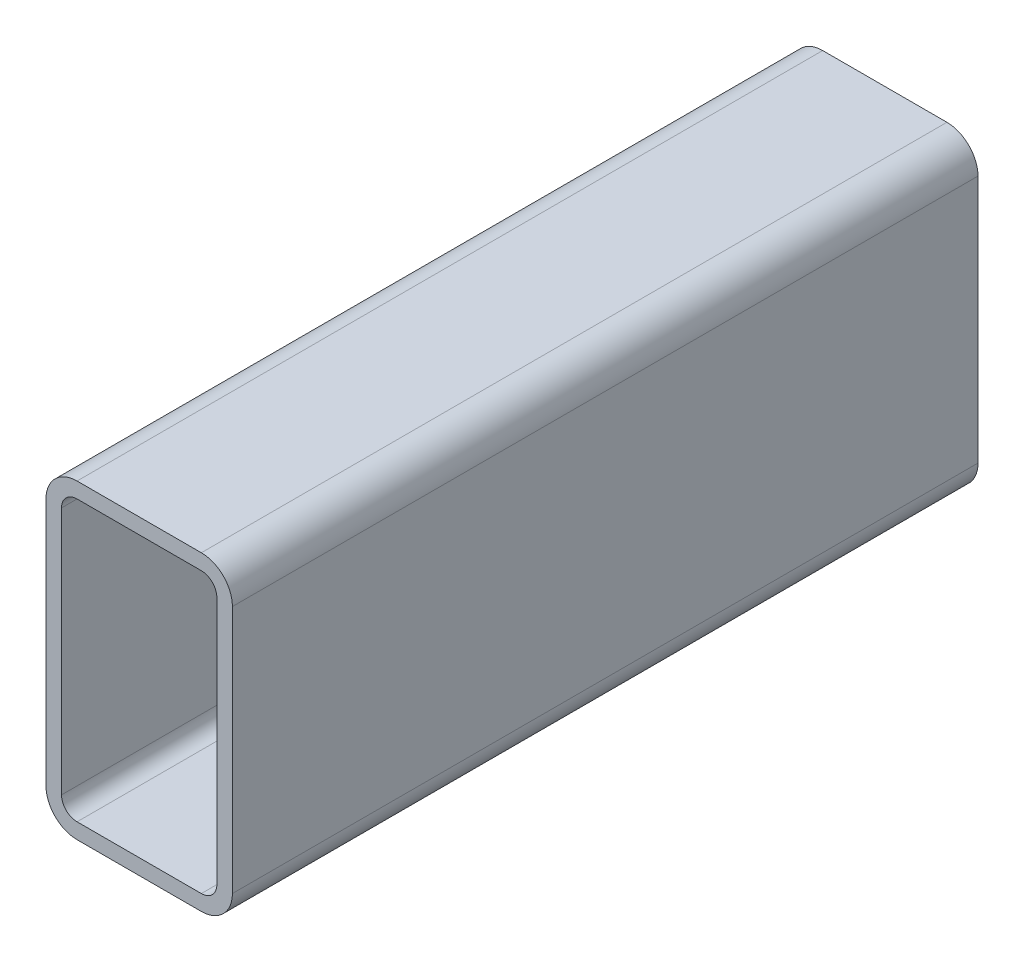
ISO-10303-21;
HEADER;
FILE_DESCRIPTION(('STEP AP214'),'2;1');
FILE_NAME('part.step','',(''),(''),'','','');
FILE_SCHEMA(('AUTOMOTIVE_DESIGN { 1 0 10303 214 1 1 1 1 }'));
ENDSEC;
DATA;
#1=APPLICATION_CONTEXT('core data for automotive mechanical design processes');
#2=APPLICATION_PROTOCOL_DEFINITION('international standard','automotive_design',2000,#1);
#3=PRODUCT_CONTEXT('',#1,'mechanical');
#4=PRODUCT('Part','Part','',(#3));
#5=PRODUCT_RELATED_PRODUCT_CATEGORY('part','',(#4));
#6=PRODUCT_DEFINITION_FORMATION('','',#4);
#7=PRODUCT_DEFINITION_CONTEXT('part definition',#1,'design');
#8=PRODUCT_DEFINITION('design','',#6,#7);
#9=PRODUCT_DEFINITION_SHAPE('','',#8);
#10=(LENGTH_UNIT() NAMED_UNIT(*) SI_UNIT(.MILLI.,.METRE.));
#11=(NAMED_UNIT(*) PLANE_ANGLE_UNIT() SI_UNIT($,.RADIAN.));
#12=(NAMED_UNIT(*) SI_UNIT($,.STERADIAN.) SOLID_ANGLE_UNIT());
#13=UNCERTAINTY_MEASURE_WITH_UNIT(LENGTH_MEASURE(1.E-05),#10,'distance_accuracy_value','');
#14=(GEOMETRIC_REPRESENTATION_CONTEXT(3) GLOBAL_UNCERTAINTY_ASSIGNED_CONTEXT((#13)) GLOBAL_UNIT_ASSIGNED_CONTEXT((#10,
#11,#12)) REPRESENTATION_CONTEXT('',''));
#15=CARTESIAN_POINT('',(0.,0.,0.));
#16=DIRECTION('',(0.,0.,1.));
#17=DIRECTION('',(1.,0.,0.));
#18=AXIS2_PLACEMENT_3D('',#15,#16,#17);
#19=CARTESIAN_POINT('',(15.1891160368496,116.33485662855,304.8));
#20=DIRECTION('',(0.,0.,1.));
#21=DIRECTION('',(1.,0.,0.));
#22=AXIS2_PLACEMENT_3D('',#19,#20,#21);
#23=PLANE('',#22);
#24=CARTESIAN_POINT('',(15.1891160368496,116.33485662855,304.8));
#25=DIRECTION('',(0.,0.,1.));
#26=DIRECTION('',(1.,0.,0.));
#27=AXIS2_PLACEMENT_3D('',#24,#25,#26);
#28=CIRCLE('',#27,12.7);
#29=CARTESIAN_POINT('',(15.1891160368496,129.03485662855,304.8));
#30=VERTEX_POINT('',#29);
#31=CARTESIAN_POINT('',(2.48911603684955,116.33485662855,304.8));
#32=VERTEX_POINT('',#31);
#33=EDGE_CURVE('E211',#30,#32,#28,.T.);
#34=ORIENTED_EDGE('',*,*,#33,.T.);
#35=DIRECTION('',(0.,-1.,0.));
#36=VECTOR('',#35,1.);
#37=CARTESIAN_POINT('',(2.48911603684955,14.73485662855,304.8));
#38=LINE('',#37,#36);
#39=CARTESIAN_POINT('',(2.48911603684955,14.73485662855,304.8));
#40=VERTEX_POINT('',#39);
#41=EDGE_CURVE('E214',#32,#40,#38,.T.);
#42=ORIENTED_EDGE('',*,*,#41,.T.);
#43=CARTESIAN_POINT('',(15.1891160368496,14.73485662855,304.8));
#44=DIRECTION('',(0.,0.,1.));
#45=DIRECTION('',(1.,0.,0.));
#46=AXIS2_PLACEMENT_3D('',#43,#44,#45);
#47=CIRCLE('',#46,12.7);
#48=CARTESIAN_POINT('',(15.1891160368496,2.03485662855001,304.8));
#49=VERTEX_POINT('',#48);
#50=EDGE_CURVE('E217',#40,#49,#47,.T.);
#51=ORIENTED_EDGE('',*,*,#50,.T.);
#52=DIRECTION('',(1.,0.,0.));
#53=VECTOR('',#52,1.);
#54=CARTESIAN_POINT('',(65.9891160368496,2.03485662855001,304.8));
#55=LINE('',#54,#53);
#56=CARTESIAN_POINT('',(65.9891160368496,2.03485662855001,304.8));
#57=VERTEX_POINT('',#56);
#58=EDGE_CURVE('E219',#49,#57,#55,.T.);
#59=ORIENTED_EDGE('',*,*,#58,.T.);
#60=CARTESIAN_POINT('',(65.9891160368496,14.73485662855,304.8));
#61=DIRECTION('',(0.,0.,1.));
#62=DIRECTION('',(1.,0.,0.));
#63=AXIS2_PLACEMENT_3D('',#60,#61,#62);
#64=CIRCLE('',#63,12.7);
#65=CARTESIAN_POINT('',(78.6891160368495,14.73485662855,304.8));
#66=VERTEX_POINT('',#65);
#67=EDGE_CURVE('E221',#57,#66,#64,.T.);
#68=ORIENTED_EDGE('',*,*,#67,.T.);
#69=DIRECTION('',(0.,1.,0.));
#70=VECTOR('',#69,1.);
#71=CARTESIAN_POINT('',(78.6891160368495,116.33485662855,304.8));
#72=LINE('',#71,#70);
#73=CARTESIAN_POINT('',(78.6891160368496,116.33485662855,304.8));
#74=VERTEX_POINT('',#73);
#75=EDGE_CURVE('E223',#66,#74,#72,.T.);
#76=ORIENTED_EDGE('',*,*,#75,.T.);
#77=CARTESIAN_POINT('',(65.9891160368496,116.33485662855,304.8));
#78=DIRECTION('',(0.,0.,1.));
#79=DIRECTION('',(1.,0.,0.));
#80=AXIS2_PLACEMENT_3D('',#77,#78,#79);
#81=CIRCLE('',#80,12.7);
#82=CARTESIAN_POINT('',(65.9891160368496,129.03485662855,304.8));
#83=VERTEX_POINT('',#82);
#84=EDGE_CURVE('E225',#74,#83,#81,.T.);
#85=ORIENTED_EDGE('',*,*,#84,.T.);
#86=DIRECTION('',(-1.,0.,0.));
#87=VECTOR('',#86,1.);
#88=CARTESIAN_POINT('',(15.1891160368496,129.03485662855,304.8));
#89=LINE('',#88,#87);
#90=EDGE_CURVE('E227',#83,#30,#89,.T.);
#91=ORIENTED_EDGE('',*,*,#90,.T.);
#92=EDGE_LOOP('',(#34,#42,#51,#59,#68,#76,#85,#91));
#93=FACE_BOUND('',#92,.T.);
#94=DIRECTION('',(0.,-1.,0.));
#95=VECTOR('',#94,1.);
#96=CARTESIAN_POINT('',(8.83911603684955,14.73485662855,304.8));
#97=LINE('',#96,#95);
#98=CARTESIAN_POINT('',(8.83911603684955,116.33485662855,304.8));
#99=VERTEX_POINT('',#98);
#100=CARTESIAN_POINT('',(8.83911603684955,14.73485662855,304.8));
#101=VERTEX_POINT('',#100);
#102=EDGE_CURVE('E154',#99,#101,#97,.T.);
#103=ORIENTED_EDGE('',*,*,#102,.F.);
#104=CARTESIAN_POINT('',(15.1891160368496,116.33485662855,304.8));
#105=DIRECTION('',(0.,0.,1.));
#106=DIRECTION('',(1.,0.,0.));
#107=AXIS2_PLACEMENT_3D('',#104,#105,#106);
#108=CIRCLE('',#107,6.35000000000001);
#109=CARTESIAN_POINT('',(15.1891160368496,122.68485662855,304.8));
#110=VERTEX_POINT('',#109);
#111=EDGE_CURVE('E146',#110,#99,#108,.T.);
#112=ORIENTED_EDGE('',*,*,#111,.F.);
#113=DIRECTION('',(-1.,0.,0.));
#114=VECTOR('',#113,1.);
#115=CARTESIAN_POINT('',(15.1891160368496,122.68485662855,304.8));
#116=LINE('',#115,#114);
#117=CARTESIAN_POINT('',(65.9891160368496,122.68485662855,304.8));
#118=VERTEX_POINT('',#117);
#119=EDGE_CURVE('E179',#118,#110,#116,.T.);
#120=ORIENTED_EDGE('',*,*,#119,.F.);
#121=CARTESIAN_POINT('',(65.9891160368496,116.33485662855,304.8));
#122=DIRECTION('',(0.,0.,1.));
#123=DIRECTION('',(1.,0.,0.));
#124=AXIS2_PLACEMENT_3D('',#121,#122,#123);
#125=CIRCLE('',#124,6.35);
#126=CARTESIAN_POINT('',(72.3391160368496,116.33485662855,304.8));
#127=VERTEX_POINT('',#126);
#128=EDGE_CURVE('E177',#127,#118,#125,.T.);
#129=ORIENTED_EDGE('',*,*,#128,.F.);
#130=DIRECTION('',(0.,1.,0.));
#131=VECTOR('',#130,1.);
#132=CARTESIAN_POINT('',(72.3391160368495,116.33485662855,304.8));
#133=LINE('',#132,#131);
#134=CARTESIAN_POINT('',(72.3391160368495,14.73485662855,304.8));
#135=VERTEX_POINT('',#134);
#136=EDGE_CURVE('E175',#135,#127,#133,.T.);
#137=ORIENTED_EDGE('',*,*,#136,.F.);
#138=CARTESIAN_POINT('',(65.9891160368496,14.73485662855,304.8));
#139=DIRECTION('',(0.,0.,1.));
#140=DIRECTION('',(1.,0.,0.));
#141=AXIS2_PLACEMENT_3D('',#138,#139,#140);
#142=CIRCLE('',#141,6.35);
#143=CARTESIAN_POINT('',(65.9891160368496,8.38485662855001,304.8));
#144=VERTEX_POINT('',#143);
#145=EDGE_CURVE('E173',#144,#135,#142,.T.);
#146=ORIENTED_EDGE('',*,*,#145,.F.);
#147=DIRECTION('',(1.,0.,0.));
#148=VECTOR('',#147,1.);
#149=CARTESIAN_POINT('',(65.9891160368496,8.38485662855,304.8));
#150=LINE('',#149,#148);
#151=CARTESIAN_POINT('',(15.1891160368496,8.38485662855,304.8));
#152=VERTEX_POINT('',#151);
#153=EDGE_CURVE('E169',#152,#144,#150,.T.);
#154=ORIENTED_EDGE('',*,*,#153,.F.);
#155=CARTESIAN_POINT('',(15.1891160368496,14.73485662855,304.8));
#156=DIRECTION('',(0.,0.,1.));
#157=DIRECTION('',(1.,0.,0.));
#158=AXIS2_PLACEMENT_3D('',#155,#156,#157);
#159=CIRCLE('',#158,6.35);
#160=EDGE_CURVE('E167',#101,#152,#159,.T.);
#161=ORIENTED_EDGE('',*,*,#160,.F.);
#162=EDGE_LOOP('',(#103,#112,#120,#129,#137,#146,#154,#161));
#163=FACE_BOUND('',#162,.T.);
#164=ADVANCED_FACE('F33',(#93,#163),#23,.T.);
#165=CARTESIAN_POINT('',(15.1891160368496,116.33485662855,0.));
#166=DIRECTION('',(0.,0.,1.));
#167=DIRECTION('',(1.,0.,0.));
#168=AXIS2_PLACEMENT_3D('',#165,#166,#167);
#169=PLANE('',#168);
#170=CARTESIAN_POINT('',(15.1891160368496,116.33485662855,0.));
#171=DIRECTION('',(0.,0.,1.));
#172=DIRECTION('',(1.,0.,0.));
#173=AXIS2_PLACEMENT_3D('',#170,#171,#172);
#174=CIRCLE('',#173,12.7);
#175=CARTESIAN_POINT('',(15.1891160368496,129.03485662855,0.));
#176=VERTEX_POINT('',#175);
#177=CARTESIAN_POINT('',(2.48911603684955,116.33485662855,0.));
#178=VERTEX_POINT('',#177);
#179=EDGE_CURVE('E162',#176,#178,#174,.T.);
#180=ORIENTED_EDGE('',*,*,#179,.F.);
#181=DIRECTION('',(-1.,0.,0.));
#182=VECTOR('',#181,1.);
#183=CARTESIAN_POINT('',(15.1891160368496,129.03485662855,0.));
#184=LINE('',#183,#182);
#185=CARTESIAN_POINT('',(65.9891160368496,129.03485662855,0.));
#186=VERTEX_POINT('',#185);
#187=EDGE_CURVE('E215',#186,#176,#184,.T.);
#188=ORIENTED_EDGE('',*,*,#187,.F.);
#189=CARTESIAN_POINT('',(65.9891160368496,116.33485662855,0.));
#190=DIRECTION('',(0.,0.,1.));
#191=DIRECTION('',(1.,0.,0.));
#192=AXIS2_PLACEMENT_3D('',#189,#190,#191);
#193=CIRCLE('',#192,12.7);
#194=CARTESIAN_POINT('',(78.6891160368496,116.33485662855,0.));
#195=VERTEX_POINT('',#194);
#196=EDGE_CURVE('E242',#195,#186,#193,.T.);
#197=ORIENTED_EDGE('',*,*,#196,.F.);
#198=DIRECTION('',(0.,1.,0.));
#199=VECTOR('',#198,1.);
#200=CARTESIAN_POINT('',(78.6891160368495,116.33485662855,0.));
#201=LINE('',#200,#199);
#202=CARTESIAN_POINT('',(78.6891160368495,14.73485662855,0.));
#203=VERTEX_POINT('',#202);
#204=EDGE_CURVE('E240',#203,#195,#201,.T.);
#205=ORIENTED_EDGE('',*,*,#204,.F.);
#206=CARTESIAN_POINT('',(65.9891160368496,14.73485662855,0.));
#207=DIRECTION('',(0.,0.,1.));
#208=DIRECTION('',(1.,0.,0.));
#209=AXIS2_PLACEMENT_3D('',#206,#207,#208);
#210=CIRCLE('',#209,12.7);
#211=CARTESIAN_POINT('',(65.9891160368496,2.03485662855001,0.));
#212=VERTEX_POINT('',#211);
#213=EDGE_CURVE('E238',#212,#203,#210,.T.);
#214=ORIENTED_EDGE('',*,*,#213,.F.);
#215=DIRECTION('',(1.,0.,0.));
#216=VECTOR('',#215,1.);
#217=CARTESIAN_POINT('',(65.9891160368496,2.03485662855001,0.));
#218=LINE('',#217,#216);
#219=CARTESIAN_POINT('',(15.1891160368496,2.03485662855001,0.));
#220=VERTEX_POINT('',#219);
#221=EDGE_CURVE('E236',#220,#212,#218,.T.);
#222=ORIENTED_EDGE('',*,*,#221,.F.);
#223=CARTESIAN_POINT('',(15.1891160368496,14.73485662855,0.));
#224=DIRECTION('',(0.,0.,1.));
#225=DIRECTION('',(1.,0.,0.));
#226=AXIS2_PLACEMENT_3D('',#223,#224,#225);
#227=CIRCLE('',#226,12.7);
#228=CARTESIAN_POINT('',(2.48911603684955,14.73485662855,0.));
#229=VERTEX_POINT('',#228);
#230=EDGE_CURVE('E234',#229,#220,#227,.T.);
#231=ORIENTED_EDGE('',*,*,#230,.F.);
#232=DIRECTION('',(0.,-1.,0.));
#233=VECTOR('',#232,1.);
#234=CARTESIAN_POINT('',(2.48911603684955,14.73485662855,0.));
#235=LINE('',#234,#233);
#236=EDGE_CURVE('E232',#178,#229,#235,.T.);
#237=ORIENTED_EDGE('',*,*,#236,.F.);
#238=EDGE_LOOP('',(#180,#188,#197,#205,#214,#222,#231,#237));
#239=FACE_BOUND('',#238,.T.);
#240=CARTESIAN_POINT('',(15.1891160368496,116.33485662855,0.));
#241=DIRECTION('',(0.,0.,1.));
#242=DIRECTION('',(1.,0.,0.));
#243=AXIS2_PLACEMENT_3D('',#240,#241,#242);
#244=CIRCLE('',#243,6.35000000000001);
#245=CARTESIAN_POINT('',(15.1891160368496,122.68485662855,0.));
#246=VERTEX_POINT('',#245);
#247=CARTESIAN_POINT('',(8.83911603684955,116.33485662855,0.));
#248=VERTEX_POINT('',#247);
#249=EDGE_CURVE('E56',#246,#248,#244,.T.);
#250=ORIENTED_EDGE('',*,*,#249,.T.);
#251=DIRECTION('',(0.,-1.,0.));
#252=VECTOR('',#251,1.);
#253=CARTESIAN_POINT('',(8.83911603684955,14.73485662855,0.));
#254=LINE('',#253,#252);
#255=CARTESIAN_POINT('',(8.83911603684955,14.73485662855,0.));
#256=VERTEX_POINT('',#255);
#257=EDGE_CURVE('E161',#248,#256,#254,.T.);
#258=ORIENTED_EDGE('',*,*,#257,.T.);
#259=CARTESIAN_POINT('',(15.1891160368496,14.73485662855,0.));
#260=DIRECTION('',(0.,0.,1.));
#261=DIRECTION('',(1.,0.,0.));
#262=AXIS2_PLACEMENT_3D('',#259,#260,#261);
#263=CIRCLE('',#262,6.35);
#264=CARTESIAN_POINT('',(15.1891160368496,8.38485662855,0.));
#265=VERTEX_POINT('',#264);
#266=EDGE_CURVE('E183',#256,#265,#263,.T.);
#267=ORIENTED_EDGE('',*,*,#266,.T.);
#268=DIRECTION('',(1.,0.,0.));
#269=VECTOR('',#268,1.);
#270=CARTESIAN_POINT('',(65.9891160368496,8.38485662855,0.));
#271=LINE('',#270,#269);
#272=CARTESIAN_POINT('',(65.9891160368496,8.38485662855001,0.));
#273=VERTEX_POINT('',#272);
#274=EDGE_CURVE('E186',#265,#273,#271,.T.);
#275=ORIENTED_EDGE('',*,*,#274,.T.);
#276=CARTESIAN_POINT('',(65.9891160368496,14.73485662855,0.));
#277=DIRECTION('',(0.,0.,1.));
#278=DIRECTION('',(1.,0.,0.));
#279=AXIS2_PLACEMENT_3D('',#276,#277,#278);
#280=CIRCLE('',#279,6.35);
#281=CARTESIAN_POINT('',(72.3391160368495,14.73485662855,0.));
#282=VERTEX_POINT('',#281);
#283=EDGE_CURVE('E189',#273,#282,#280,.T.);
#284=ORIENTED_EDGE('',*,*,#283,.T.);
#285=DIRECTION('',(0.,1.,0.));
#286=VECTOR('',#285,1.);
#287=CARTESIAN_POINT('',(72.3391160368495,116.33485662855,0.));
#288=LINE('',#287,#286);
#289=CARTESIAN_POINT('',(72.3391160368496,116.33485662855,0.));
#290=VERTEX_POINT('',#289);
#291=EDGE_CURVE('E192',#282,#290,#288,.T.);
#292=ORIENTED_EDGE('',*,*,#291,.T.);
#293=CARTESIAN_POINT('',(65.9891160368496,116.33485662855,0.));
#294=DIRECTION('',(0.,0.,1.));
#295=DIRECTION('',(1.,0.,0.));
#296=AXIS2_PLACEMENT_3D('',#293,#294,#295);
#297=CIRCLE('',#296,6.35);
#298=CARTESIAN_POINT('',(65.9891160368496,122.68485662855,0.));
#299=VERTEX_POINT('',#298);
#300=EDGE_CURVE('E195',#290,#299,#297,.T.);
#301=ORIENTED_EDGE('',*,*,#300,.T.);
#302=DIRECTION('',(-1.,0.,0.));
#303=VECTOR('',#302,1.);
#304=CARTESIAN_POINT('',(15.1891160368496,122.68485662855,0.));
#305=LINE('',#304,#303);
#306=EDGE_CURVE('E155',#299,#246,#305,.T.);
#307=ORIENTED_EDGE('',*,*,#306,.T.);
#308=EDGE_LOOP('',(#250,#258,#267,#275,#284,#292,#301,#307));
#309=FACE_BOUND('',#308,.T.);
#310=ADVANCED_FACE('F272',(#239,#309),#169,.F.);
#311=CARTESIAN_POINT('',(15.1891160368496,116.33485662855,304.8));
#312=DIRECTION('',(0.,0.,-1.));
#313=DIRECTION('',(-1.,0.,0.));
#314=AXIS2_PLACEMENT_3D('',#311,#312,#313);
#315=CYLINDRICAL_SURFACE('',#314,12.7);
#316=ORIENTED_EDGE('',*,*,#179,.T.);
#317=DIRECTION('',(0.,0.,-1.));
#318=VECTOR('',#317,1.);
#319=CARTESIAN_POINT('',(2.48911603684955,116.33485662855,304.8));
#320=LINE('',#319,#318);
#321=EDGE_CURVE('E11',#32,#178,#320,.T.);
#322=ORIENTED_EDGE('',*,*,#321,.F.);
#323=ORIENTED_EDGE('',*,*,#33,.F.);
#324=DIRECTION('',(0.,0.,-1.));
#325=VECTOR('',#324,1.);
#326=CARTESIAN_POINT('',(15.1891160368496,129.03485662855,304.8));
#327=LINE('',#326,#325);
#328=EDGE_CURVE('E229',#30,#176,#327,.T.);
#329=ORIENTED_EDGE('',*,*,#328,.T.);
#330=EDGE_LOOP('',(#316,#322,#323,#329));
#331=FACE_BOUND('',#330,.T.);
#332=ADVANCED_FACE('F35',(#331),#315,.T.);
#333=CARTESIAN_POINT('',(2.48911603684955,14.73485662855,304.8));
#334=DIRECTION('',(1.,0.,0.));
#335=DIRECTION('',(0.,0.,-1.));
#336=AXIS2_PLACEMENT_3D('',#333,#334,#335);
#337=PLANE('',#336);
#338=ORIENTED_EDGE('',*,*,#236,.T.);
#339=DIRECTION('',(0.,0.,-1.));
#340=VECTOR('',#339,1.);
#341=CARTESIAN_POINT('',(2.48911603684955,14.73485662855,304.8));
#342=LINE('',#341,#340);
#343=EDGE_CURVE('E41',#40,#229,#342,.T.);
#344=ORIENTED_EDGE('',*,*,#343,.F.);
#345=ORIENTED_EDGE('',*,*,#41,.F.);
#346=ORIENTED_EDGE('',*,*,#321,.T.);
#347=EDGE_LOOP('',(#338,#344,#345,#346));
#348=FACE_BOUND('',#347,.T.);
#349=ADVANCED_FACE('F289',(#348),#337,.F.);
#350=CARTESIAN_POINT('',(15.1891160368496,14.73485662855,304.8));
#351=DIRECTION('',(0.,0.,-1.));
#352=DIRECTION('',(-1.,0.,0.));
#353=AXIS2_PLACEMENT_3D('',#350,#351,#352);
#354=CYLINDRICAL_SURFACE('',#353,12.7);
#355=ORIENTED_EDGE('',*,*,#230,.T.);
#356=DIRECTION('',(0.,0.,-1.));
#357=VECTOR('',#356,1.);
#358=CARTESIAN_POINT('',(15.1891160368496,2.03485662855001,304.8));
#359=LINE('',#358,#357);
#360=EDGE_CURVE('E259',#49,#220,#359,.T.);
#361=ORIENTED_EDGE('',*,*,#360,.F.);
#362=ORIENTED_EDGE('',*,*,#50,.F.);
#363=ORIENTED_EDGE('',*,*,#343,.T.);
#364=EDGE_LOOP('',(#355,#361,#362,#363));
#365=FACE_BOUND('',#364,.T.);
#366=ADVANCED_FACE('F266',(#365),#354,.T.);
#367=CARTESIAN_POINT('',(65.9891160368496,2.03485662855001,304.8));
#368=DIRECTION('',(0.,1.,0.));
#369=DIRECTION('',(0.,0.,1.));
#370=AXIS2_PLACEMENT_3D('',#367,#368,#369);
#371=PLANE('',#370);
#372=ORIENTED_EDGE('',*,*,#221,.T.);
#373=DIRECTION('',(0.,0.,-1.));
#374=VECTOR('',#373,1.);
#375=CARTESIAN_POINT('',(65.9891160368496,2.03485662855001,304.8));
#376=LINE('',#375,#374);
#377=EDGE_CURVE('E256',#57,#212,#376,.T.);
#378=ORIENTED_EDGE('',*,*,#377,.F.);
#379=ORIENTED_EDGE('',*,*,#58,.F.);
#380=ORIENTED_EDGE('',*,*,#360,.T.);
#381=EDGE_LOOP('',(#372,#378,#379,#380));
#382=FACE_BOUND('',#381,.T.);
#383=ADVANCED_FACE('F278',(#382),#371,.F.);
#384=CARTESIAN_POINT('',(65.9891160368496,14.73485662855,304.8));
#385=DIRECTION('',(0.,0.,-1.));
#386=DIRECTION('',(-1.,0.,0.));
#387=AXIS2_PLACEMENT_3D('',#384,#385,#386);
#388=CYLINDRICAL_SURFACE('',#387,12.7);
#389=ORIENTED_EDGE('',*,*,#213,.T.);
#390=DIRECTION('',(0.,0.,-1.));
#391=VECTOR('',#390,1.);
#392=CARTESIAN_POINT('',(78.6891160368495,14.73485662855,304.8));
#393=LINE('',#392,#391);
#394=EDGE_CURVE('E253',#66,#203,#393,.T.);
#395=ORIENTED_EDGE('',*,*,#394,.F.);
#396=ORIENTED_EDGE('',*,*,#67,.F.);
#397=ORIENTED_EDGE('',*,*,#377,.T.);
#398=EDGE_LOOP('',(#389,#395,#396,#397));
#399=FACE_BOUND('',#398,.T.);
#400=ADVANCED_FACE('F282',(#399),#388,.T.);
#401=CARTESIAN_POINT('',(78.6891160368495,116.33485662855,304.8));
#402=DIRECTION('',(-1.,0.,0.));
#403=DIRECTION('',(0.,0.,1.));
#404=AXIS2_PLACEMENT_3D('',#401,#402,#403);
#405=PLANE('',#404);
#406=ORIENTED_EDGE('',*,*,#204,.T.);
#407=DIRECTION('',(0.,0.,-1.));
#408=VECTOR('',#407,1.);
#409=CARTESIAN_POINT('',(78.6891160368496,116.33485662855,304.8));
#410=LINE('',#409,#408);
#411=EDGE_CURVE('E250',#74,#195,#410,.T.);
#412=ORIENTED_EDGE('',*,*,#411,.F.);
#413=ORIENTED_EDGE('',*,*,#75,.F.);
#414=ORIENTED_EDGE('',*,*,#394,.T.);
#415=EDGE_LOOP('',(#406,#412,#413,#414));
#416=FACE_BOUND('',#415,.T.);
#417=ADVANCED_FACE('F302',(#416),#405,.F.);
#418=CARTESIAN_POINT('',(65.9891160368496,116.33485662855,304.8));
#419=DIRECTION('',(0.,0.,-1.));
#420=DIRECTION('',(-1.,0.,0.));
#421=AXIS2_PLACEMENT_3D('',#418,#419,#420);
#422=CYLINDRICAL_SURFACE('',#421,12.7);
#423=ORIENTED_EDGE('',*,*,#196,.T.);
#424=DIRECTION('',(0.,0.,-1.));
#425=VECTOR('',#424,1.);
#426=CARTESIAN_POINT('',(65.9891160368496,129.03485662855,304.8));
#427=LINE('',#426,#425);
#428=EDGE_CURVE('E247',#83,#186,#427,.T.);
#429=ORIENTED_EDGE('',*,*,#428,.F.);
#430=ORIENTED_EDGE('',*,*,#84,.F.);
#431=ORIENTED_EDGE('',*,*,#411,.T.);
#432=EDGE_LOOP('',(#423,#429,#430,#431));
#433=FACE_BOUND('',#432,.T.);
#434=ADVANCED_FACE('F300',(#433),#422,.T.);
#435=CARTESIAN_POINT('',(15.1891160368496,129.03485662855,304.8));
#436=DIRECTION('',(0.,-1.,0.));
#437=DIRECTION('',(0.,0.,-1.));
#438=AXIS2_PLACEMENT_3D('',#435,#436,#437);
#439=PLANE('',#438);
#440=ORIENTED_EDGE('',*,*,#187,.T.);
#441=ORIENTED_EDGE('',*,*,#328,.F.);
#442=ORIENTED_EDGE('',*,*,#90,.F.);
#443=ORIENTED_EDGE('',*,*,#428,.T.);
#444=EDGE_LOOP('',(#440,#441,#442,#443));
#445=FACE_BOUND('',#444,.T.);
#446=ADVANCED_FACE('F295',(#445),#439,.F.);
#447=CARTESIAN_POINT('',(15.1891160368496,116.33485662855,304.8));
#448=DIRECTION('',(0.,0.,-1.));
#449=DIRECTION('',(-1.,0.,0.));
#450=AXIS2_PLACEMENT_3D('',#447,#448,#449);
#451=CYLINDRICAL_SURFACE('',#450,6.35000000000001);
#452=ORIENTED_EDGE('',*,*,#249,.F.);
#453=DIRECTION('',(0.,0.,-1.));
#454=VECTOR('',#453,1.);
#455=CARTESIAN_POINT('',(15.1891160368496,122.68485662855,304.8));
#456=LINE('',#455,#454);
#457=EDGE_CURVE('E150',#110,#246,#456,.T.);
#458=ORIENTED_EDGE('',*,*,#457,.F.);
#459=ORIENTED_EDGE('',*,*,#111,.T.);
#460=DIRECTION('',(0.,0.,-1.));
#461=VECTOR('',#460,1.);
#462=CARTESIAN_POINT('',(8.83911603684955,116.33485662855,304.8));
#463=LINE('',#462,#461);
#464=EDGE_CURVE('E149',#99,#248,#463,.T.);
#465=ORIENTED_EDGE('',*,*,#464,.T.);
#466=EDGE_LOOP('',(#452,#458,#459,#465));
#467=FACE_BOUND('',#466,.T.);
#468=ADVANCED_FACE('F148',(#467),#451,.F.);
#469=CARTESIAN_POINT('',(8.83911603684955,14.73485662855,304.8));
#470=DIRECTION('',(1.,0.,0.));
#471=DIRECTION('',(0.,0.,-1.));
#472=AXIS2_PLACEMENT_3D('',#469,#470,#471);
#473=PLANE('',#472);
#474=ORIENTED_EDGE('',*,*,#257,.F.);
#475=ORIENTED_EDGE('',*,*,#464,.F.);
#476=ORIENTED_EDGE('',*,*,#102,.T.);
#477=DIRECTION('',(0.,0.,-1.));
#478=VECTOR('',#477,1.);
#479=CARTESIAN_POINT('',(8.83911603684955,14.73485662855,304.8));
#480=LINE('',#479,#478);
#481=EDGE_CURVE('E163',#101,#256,#480,.T.);
#482=ORIENTED_EDGE('',*,*,#481,.T.);
#483=EDGE_LOOP('',(#474,#475,#476,#482));
#484=FACE_BOUND('',#483,.T.);
#485=ADVANCED_FACE('F158',(#484),#473,.T.);
#486=CARTESIAN_POINT('',(15.1891160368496,14.73485662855,304.8));
#487=DIRECTION('',(0.,0.,-1.));
#488=DIRECTION('',(-1.,0.,0.));
#489=AXIS2_PLACEMENT_3D('',#486,#487,#488);
#490=CYLINDRICAL_SURFACE('',#489,6.35);
#491=ORIENTED_EDGE('',*,*,#266,.F.);
#492=ORIENTED_EDGE('',*,*,#481,.F.);
#493=ORIENTED_EDGE('',*,*,#160,.T.);
#494=DIRECTION('',(0.,0.,-1.));
#495=VECTOR('',#494,1.);
#496=CARTESIAN_POINT('',(15.1891160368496,8.38485662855,304.8));
#497=LINE('',#496,#495);
#498=EDGE_CURVE('E208',#152,#265,#497,.T.);
#499=ORIENTED_EDGE('',*,*,#498,.T.);
#500=EDGE_LOOP('',(#491,#492,#493,#499));
#501=FACE_BOUND('',#500,.T.);
#502=ADVANCED_FACE('F327',(#501),#490,.F.);
#503=CARTESIAN_POINT('',(65.9891160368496,8.38485662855,304.8));
#504=DIRECTION('',(0.,1.,0.));
#505=DIRECTION('',(0.,0.,1.));
#506=AXIS2_PLACEMENT_3D('',#503,#504,#505);
#507=PLANE('',#506);
#508=ORIENTED_EDGE('',*,*,#274,.F.);
#509=ORIENTED_EDGE('',*,*,#498,.F.);
#510=ORIENTED_EDGE('',*,*,#153,.T.);
#511=DIRECTION('',(0.,0.,-1.));
#512=VECTOR('',#511,1.);
#513=CARTESIAN_POINT('',(65.9891160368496,8.38485662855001,304.8));
#514=LINE('',#513,#512);
#515=EDGE_CURVE('E206',#144,#273,#514,.T.);
#516=ORIENTED_EDGE('',*,*,#515,.T.);
#517=EDGE_LOOP('',(#508,#509,#510,#516));
#518=FACE_BOUND('',#517,.T.);
#519=ADVANCED_FACE('F331',(#518),#507,.T.);
#520=CARTESIAN_POINT('',(65.9891160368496,14.73485662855,304.8));
#521=DIRECTION('',(0.,0.,-1.));
#522=DIRECTION('',(-1.,0.,0.));
#523=AXIS2_PLACEMENT_3D('',#520,#521,#522);
#524=CYLINDRICAL_SURFACE('',#523,6.35);
#525=ORIENTED_EDGE('',*,*,#283,.F.);
#526=ORIENTED_EDGE('',*,*,#515,.F.);
#527=ORIENTED_EDGE('',*,*,#145,.T.);
#528=DIRECTION('',(0.,0.,-1.));
#529=VECTOR('',#528,1.);
#530=CARTESIAN_POINT('',(72.3391160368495,14.73485662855,304.8));
#531=LINE('',#530,#529);
#532=EDGE_CURVE('E204',#135,#282,#531,.T.);
#533=ORIENTED_EDGE('',*,*,#532,.T.);
#534=EDGE_LOOP('',(#525,#526,#527,#533));
#535=FACE_BOUND('',#534,.T.);
#536=ADVANCED_FACE('F337',(#535),#524,.F.);
#537=CARTESIAN_POINT('',(72.3391160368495,116.33485662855,304.8));
#538=DIRECTION('',(-1.,0.,0.));
#539=DIRECTION('',(0.,0.,1.));
#540=AXIS2_PLACEMENT_3D('',#537,#538,#539);
#541=PLANE('',#540);
#542=ORIENTED_EDGE('',*,*,#291,.F.);
#543=ORIENTED_EDGE('',*,*,#532,.F.);
#544=ORIENTED_EDGE('',*,*,#136,.T.);
#545=DIRECTION('',(0.,0.,-1.));
#546=VECTOR('',#545,1.);
#547=CARTESIAN_POINT('',(72.3391160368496,116.33485662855,304.8));
#548=LINE('',#547,#546);
#549=EDGE_CURVE('E202',#127,#290,#548,.T.);
#550=ORIENTED_EDGE('',*,*,#549,.T.);
#551=EDGE_LOOP('',(#542,#543,#544,#550));
#552=FACE_BOUND('',#551,.T.);
#553=ADVANCED_FACE('F341',(#552),#541,.T.);
#554=CARTESIAN_POINT('',(65.9891160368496,116.33485662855,304.8));
#555=DIRECTION('',(0.,0.,-1.));
#556=DIRECTION('',(-1.,0.,0.));
#557=AXIS2_PLACEMENT_3D('',#554,#555,#556);
#558=CYLINDRICAL_SURFACE('',#557,6.35);
#559=ORIENTED_EDGE('',*,*,#300,.F.);
#560=ORIENTED_EDGE('',*,*,#549,.F.);
#561=ORIENTED_EDGE('',*,*,#128,.T.);
#562=DIRECTION('',(0.,0.,-1.));
#563=VECTOR('',#562,1.);
#564=CARTESIAN_POINT('',(65.9891160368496,122.68485662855,304.8));
#565=LINE('',#564,#563);
#566=EDGE_CURVE('E48',#118,#299,#565,.T.);
#567=ORIENTED_EDGE('',*,*,#566,.T.);
#568=EDGE_LOOP('',(#559,#560,#561,#567));
#569=FACE_BOUND('',#568,.T.);
#570=ADVANCED_FACE('F345',(#569),#558,.F.);
#571=CARTESIAN_POINT('',(15.1891160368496,122.68485662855,304.8));
#572=DIRECTION('',(0.,-1.,0.));
#573=DIRECTION('',(0.,0.,-1.));
#574=AXIS2_PLACEMENT_3D('',#571,#572,#573);
#575=PLANE('',#574);
#576=ORIENTED_EDGE('',*,*,#306,.F.);
#577=ORIENTED_EDGE('',*,*,#566,.F.);
#578=ORIENTED_EDGE('',*,*,#119,.T.);
#579=ORIENTED_EDGE('',*,*,#457,.T.);
#580=EDGE_LOOP('',(#576,#577,#578,#579));
#581=FACE_BOUND('',#580,.T.);
#582=ADVANCED_FACE('F349',(#581),#575,.T.);
#583=CLOSED_SHELL('',(#164,#310,#332,#349,#366,#383,#400,#417,#434,#446,#468,#485,#502,#519,
#536,#553,#570,#582));
#584=MANIFOLD_SOLID_BREP('B2',#583);
#585=ADVANCED_BREP_SHAPE_REPRESENTATION('',(#18,#584),#14);
#586=SHAPE_DEFINITION_REPRESENTATION(#9,#585);
ENDSEC;
END-ISO-10303-21;
